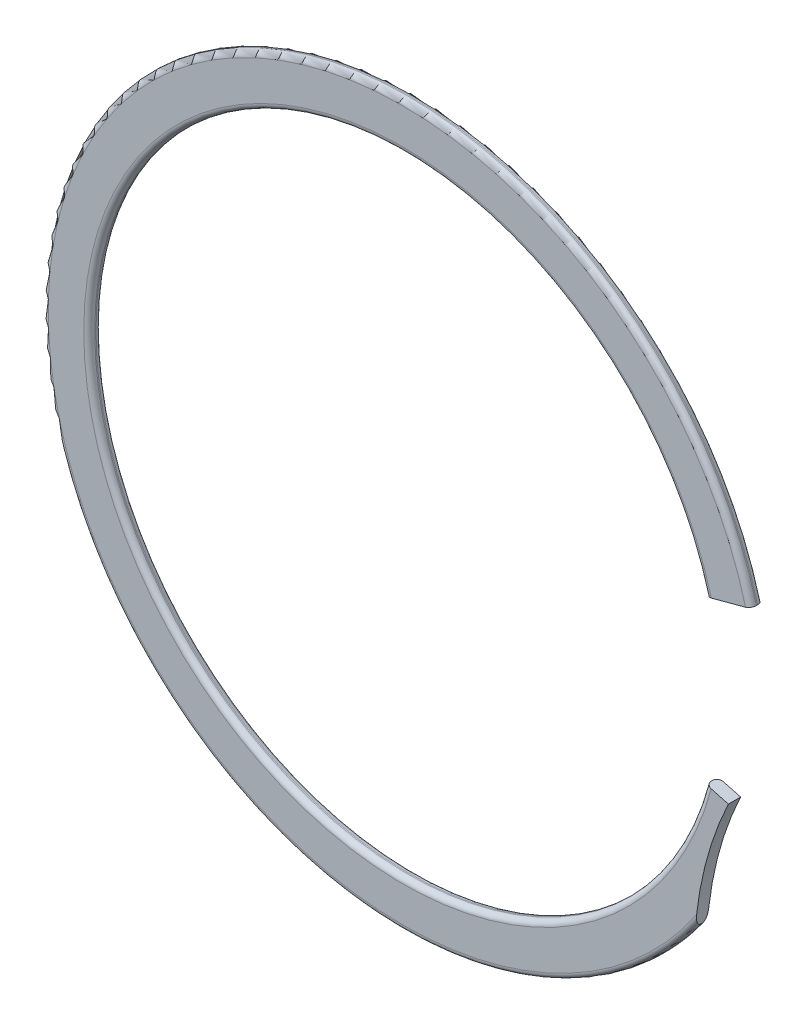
from build123d import *

# Parameters (mm, degrees)
EXTRUDE1_DEPTH = 0.3937
FILLET1_R      = 0.35433


with BuildPart() as part:
    # Sketch2 → Extrude1 (new, symmetric)
    with BuildSketch(Plane.XY):
        with BuildLine():
            Line((19.517207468, -5.22961998), (20.964743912, -5.617486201))
            ThreePointArc((20.964743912, -5.617486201), (19.544214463, -9.483316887), (18.841513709, -13.541489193))
            ThreePointArc((18.841513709, -13.541489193), (-22.825175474, 4.169644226), (22.412280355, 6.005352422))
            Line((22.412280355, 6.005352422), (19.517207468, 5.22961998))
            ThreePointArc((19.517207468, 5.22961998), (-20.2057, 0), (19.517207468, -5.22961998))
        make_face()
    extrude(amount=EXTRUDE1_DEPTH, both=True)

    # Fillet1
    fillet1_edges = [part.edges().sort_by_distance(p)[0] for p in [
        (-22.825175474, 4.169644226, 0.3937),
        (-20.2057, 0, 0.3937),
        (-22.825175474, 4.169644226, -0.3937),
        (-20.2057, 0, -0.3937),
    ]]
    fillet(fillet1_edges, radius=FILLET1_R)


solid = part.part
